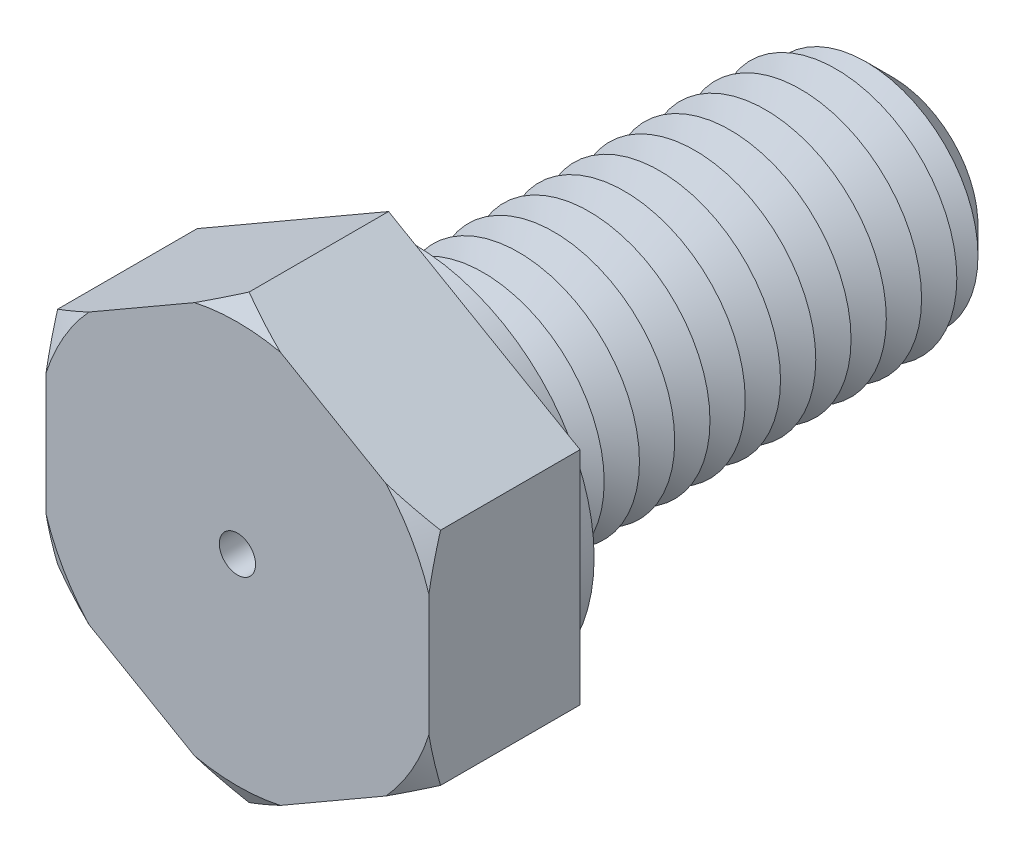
from build123d import *

# Parameters (mm, degrees)
BOSS_EXTRUDE1_DEPTH = 7.5
SKETCH3_R           = 6
BOSS_EXTRUDE2_DEPTH = 25
SKETCH4_R           = 9
BOSS_EXTRUDE3_DEPTH = 1.2
CHAMFER1_SIZE       = 1.75
LPATTERN1_COUNT     = 13
LPATTERN1_PITCH     = 1.75
SKETCH8_R           = 0.9
CUT_EXTRUDE1_DEPTH  = 32.5


with BuildPart() as part:
    # Sketch2 → Boss-Extrude1 (new body)
    with BuildSketch(Plane.XY):
        Polygon((0, 10.969655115), (-9.5, 5.484827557), (-9.5, -5.484827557), (0, -10.969655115), (9.5, -5.484827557), (9.5, 5.484827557), align=None)
    extrude(amount=BOSS_EXTRUDE1_DEPTH)

    # Sketch3 → Boss-Extrude2 (add)
    with BuildSketch(Plane(origin=(0, 0, 0), x_dir=(-1, 0, 0), z_dir=(0, 0, -1))):
        Circle(SKETCH3_R)
    extrude(amount=BOSS_EXTRUDE2_DEPTH)

    # Sketch4 → Boss-Extrude3 (add)
    with BuildSketch(Plane(origin=(0, 0, 0), x_dir=(-1, 0, 0), z_dir=(0, 0, -1))):
        with Locations(Location((0, 0, 0), (0, 0, 180))):
            Circle(SKETCH4_R)
    extrude(amount=BOSS_EXTRUDE3_DEPTH)

    # Chamfer1
    chamfer1_edges = [part.edges().sort_by_distance(p)[0] for p in [
        (6, 0, -25),
    ]]
    chamfer(chamfer1_edges, length=CHAMFER1_SIZE)

    # Sketch6 → Cut-Revolve1 (revolve, cut)
    with BuildSketch(Plane(origin=(0, 0, 0), x_dir=(0, 0, -1), z_dir=(1, 0, 0)), mode=Mode.PRIVATE) as cut_revolve1_sk:
        Polygon((1.2, 6), (2.075, 4.484455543), (2.95, 6), align=None)
    cut_revolve1 = revolve(cut_revolve1_sk.sketch.rotate(Axis((0, 0, 3.211670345), (0, 0, -1)), 90), axis=Axis((0, 0, 3.211670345), (0, 0, -1)), mode=Mode.SUBTRACT)

    # LPattern1: Cut-Revolve1 ×13
    with Locations(*[(0, 0, -i * LPATTERN1_PITCH) for i in range(1, LPATTERN1_COUNT)]):
        add(cut_revolve1, mode=Mode.SUBTRACT)

    # Sketch7 → Cut-Revolve2 (revolve, cut)
    with BuildSketch(Plane(origin=(0, 0, 0), x_dir=(0, 0, -1), z_dir=(1, 0, 0)), mode=Mode.PRIVATE) as cut_revolve2_sk:
        Polygon((-7.5, 10.969655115), (-7.5, 9.969655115), (-6.922649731, 10.969655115), align=None)
    revolve(cut_revolve2_sk.sketch.rotate(Axis((0, 0, 3.211670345), (0, 0, -1)), 270), axis=Axis((0, 0, 3.211670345), (0, 0, -1)), mode=Mode.SUBTRACT)

    # Sketch8 → Cut-Extrude1 (cut)
    with BuildSketch(Plane.XY.offset(7.5)):
        Circle(SKETCH8_R)
    extrude(amount=-CUT_EXTRUDE1_DEPTH, mode=Mode.SUBTRACT)


solid = part.part
